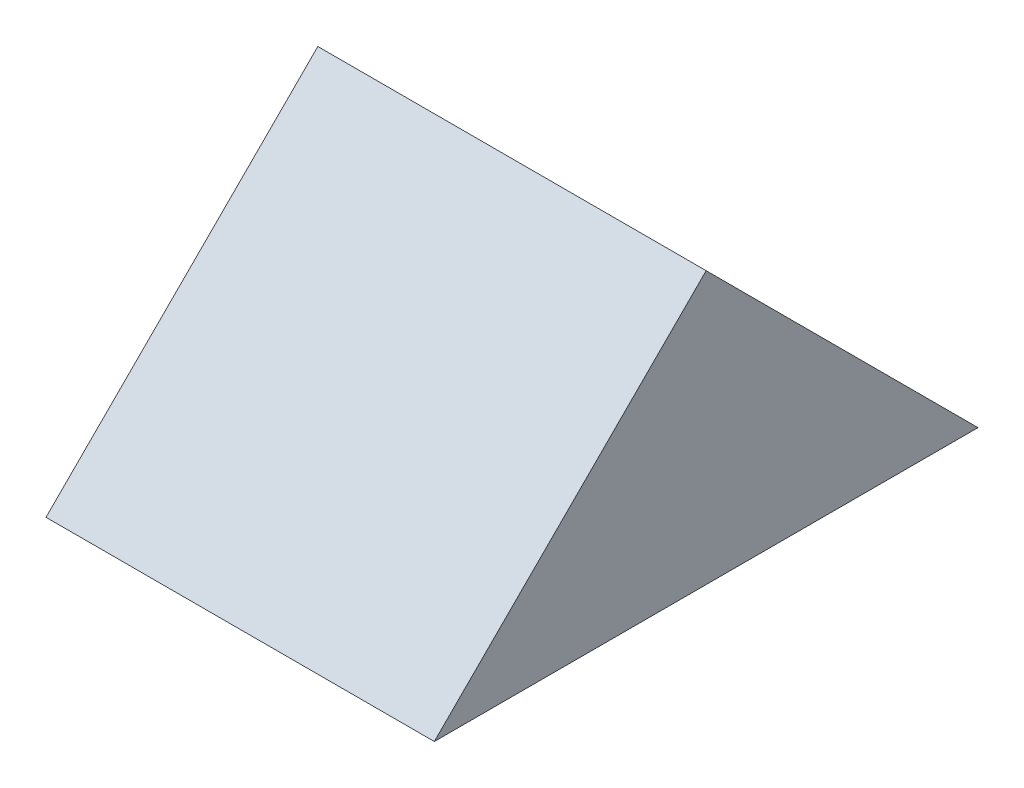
from build123d import *

# Parameters (mm, degrees)
BOSS_EXTRUDE1_DEPTH = 12.5


with BuildPart() as part:
    # Sketch1 → Boss-Extrude1 (new, symmetric)
    with BuildSketch(Plane(origin=(0, 0, 0), x_dir=(0, 0, -1), z_dir=(1, 0, 0))):
        Polygon((0, 0), (17.5, 0), (0, 17.5), (-17.5, 0), align=None)
    extrude(amount=BOSS_EXTRUDE1_DEPTH, both=True)


solid = part.part
